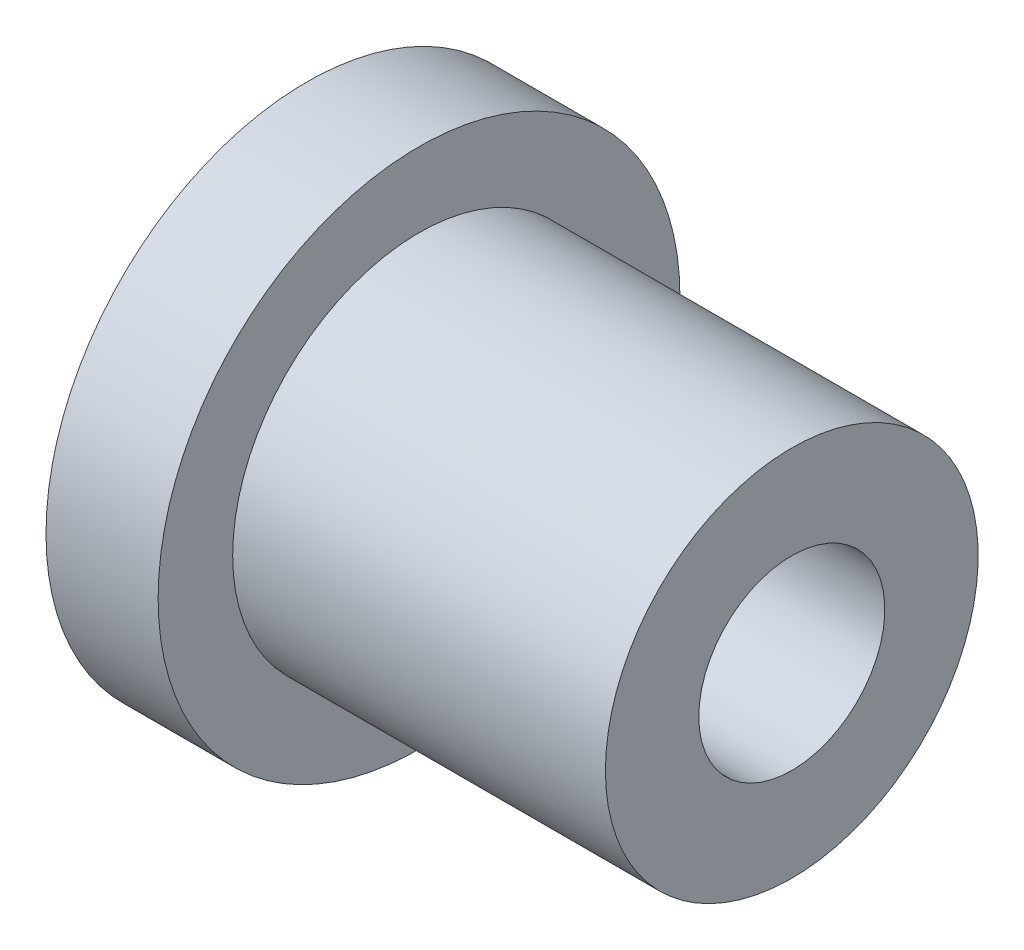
from build123d import *


with BuildPart() as part:
    # Sketch1 → Revolve1 (revolve)
    with BuildSketch(Plane.XY, mode=Mode.PRIVATE) as revolve1_sk:
        Polygon((0, 3.9624), (20.6502, 3.9624), (20.6502, 7.9375), (4.7752, 7.9375), (4.7752, 11.1125), (0, 11.1125), align=None)
    revolve(revolve1_sk.sketch.rotate(Axis((0, 0, 0), (1, 0, 0)), 90), axis=Axis((0, 0, 0), (1, 0, 0)))


solid = part.part
